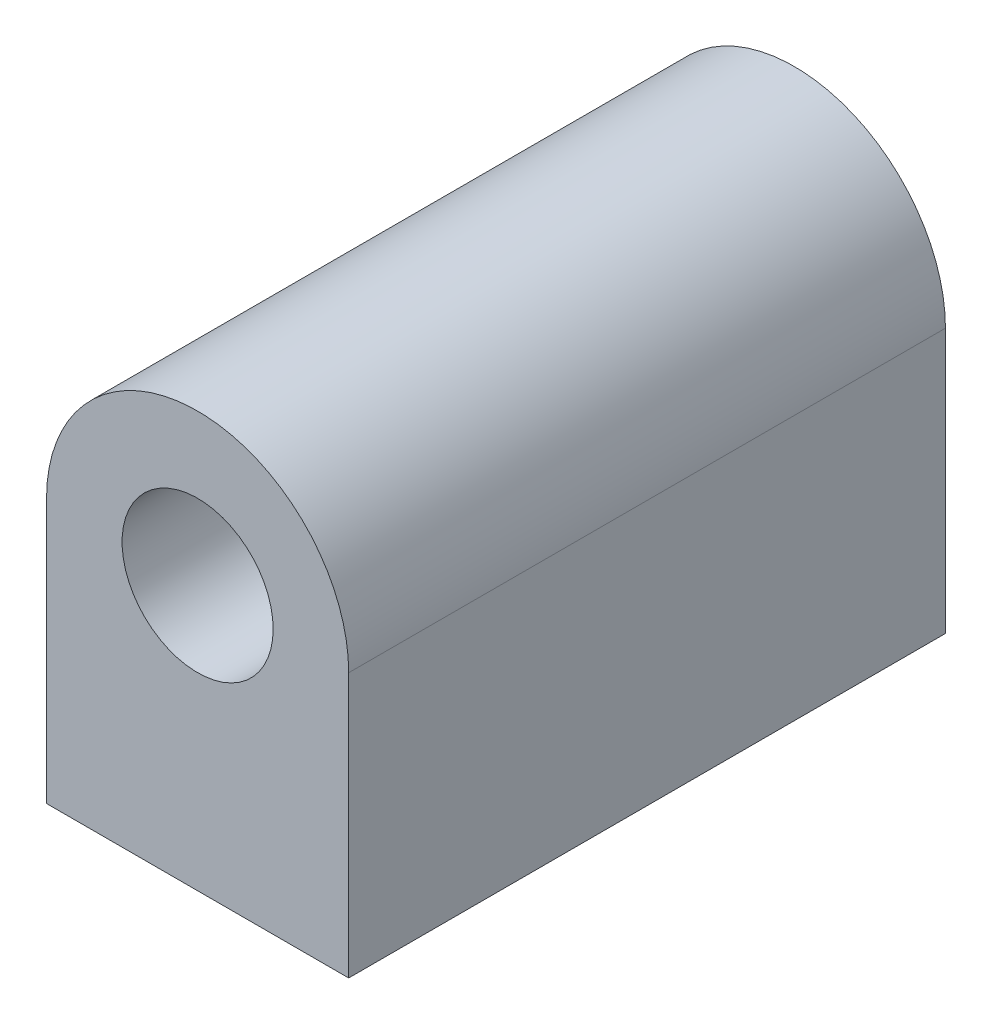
ISO-10303-21;
HEADER;
FILE_DESCRIPTION(('STEP AP214'),'2;1');
FILE_NAME('part.step','',(''),(''),'','','');
FILE_SCHEMA(('AUTOMOTIVE_DESIGN { 1 0 10303 214 1 1 1 1 }'));
ENDSEC;
DATA;
#1=APPLICATION_CONTEXT('core data for automotive mechanical design processes');
#2=APPLICATION_PROTOCOL_DEFINITION('international standard','automotive_design',2000,#1);
#3=PRODUCT_CONTEXT('',#1,'mechanical');
#4=PRODUCT('Part','Part','',(#3));
#5=PRODUCT_RELATED_PRODUCT_CATEGORY('part','',(#4));
#6=PRODUCT_DEFINITION_FORMATION('','',#4);
#7=PRODUCT_DEFINITION_CONTEXT('part definition',#1,'design');
#8=PRODUCT_DEFINITION('design','',#6,#7);
#9=PRODUCT_DEFINITION_SHAPE('','',#8);
#10=(LENGTH_UNIT() NAMED_UNIT(*) SI_UNIT(.MILLI.,.METRE.));
#11=(NAMED_UNIT(*) PLANE_ANGLE_UNIT() SI_UNIT($,.RADIAN.));
#12=(NAMED_UNIT(*) SI_UNIT($,.STERADIAN.) SOLID_ANGLE_UNIT());
#13=UNCERTAINTY_MEASURE_WITH_UNIT(LENGTH_MEASURE(1.E-05),#10,'distance_accuracy_value','');
#14=(GEOMETRIC_REPRESENTATION_CONTEXT(3) GLOBAL_UNCERTAINTY_ASSIGNED_CONTEXT((#13)) GLOBAL_UNIT_ASSIGNED_CONTEXT((#10,
#11,#12)) REPRESENTATION_CONTEXT('',''));
#15=CARTESIAN_POINT('',(0.,0.,0.));
#16=DIRECTION('',(0.,0.,1.));
#17=DIRECTION('',(1.,0.,0.));
#18=AXIS2_PLACEMENT_3D('',#15,#16,#17);
#19=CARTESIAN_POINT('',(-20.,0.,39.5));
#20=DIRECTION('',(1.,0.,0.));
#21=DIRECTION('',(0.,0.,-1.));
#22=AXIS2_PLACEMENT_3D('',#19,#20,#21);
#23=PLANE('',#22);
#24=DIRECTION('',(0.,-1.,0.));
#25=VECTOR('',#24,1.);
#26=CARTESIAN_POINT('',(-20.,0.,-39.5));
#27=LINE('',#26,#25);
#28=CARTESIAN_POINT('',(-20.,35.,-39.5));
#29=VERTEX_POINT('',#28);
#30=CARTESIAN_POINT('',(-20.,0.,-39.5));
#31=VERTEX_POINT('',#30);
#32=EDGE_CURVE('E96',#29,#31,#27,.T.);
#33=ORIENTED_EDGE('',*,*,#32,.T.);
#34=DIRECTION('',(0.,0.,-1.));
#35=VECTOR('',#34,1.);
#36=CARTESIAN_POINT('',(-20.,0.,39.5));
#37=LINE('',#36,#35);
#38=CARTESIAN_POINT('',(-20.,0.,39.5));
#39=VERTEX_POINT('',#38);
#40=EDGE_CURVE('E11',#39,#31,#37,.T.);
#41=ORIENTED_EDGE('',*,*,#40,.F.);
#42=DIRECTION('',(0.,-1.,0.));
#43=VECTOR('',#42,1.);
#44=CARTESIAN_POINT('',(-20.,0.,39.5));
#45=LINE('',#44,#43);
#46=CARTESIAN_POINT('',(-20.,35.,39.5));
#47=VERTEX_POINT('',#46);
#48=EDGE_CURVE('E84',#47,#39,#45,.T.);
#49=ORIENTED_EDGE('',*,*,#48,.F.);
#50=DIRECTION('',(0.,0.,-1.));
#51=VECTOR('',#50,1.);
#52=CARTESIAN_POINT('',(-20.,35.,39.5));
#53=LINE('',#52,#51);
#54=EDGE_CURVE('E92',#47,#29,#53,.T.);
#55=ORIENTED_EDGE('',*,*,#54,.T.);
#56=EDGE_LOOP('',(#33,#41,#49,#55));
#57=FACE_BOUND('',#56,.T.);
#58=ADVANCED_FACE('F33',(#57),#23,.F.);
#59=CARTESIAN_POINT('',(-20.,0.,39.5));
#60=DIRECTION('',(0.,1.,0.));
#61=DIRECTION('',(0.,0.,1.));
#62=AXIS2_PLACEMENT_3D('',#59,#60,#61);
#63=PLANE('',#62);
#64=DIRECTION('',(1.,0.,0.));
#65=VECTOR('',#64,1.);
#66=CARTESIAN_POINT('',(-20.,0.,-39.5));
#67=LINE('',#66,#65);
#68=CARTESIAN_POINT('',(20.,0.,-39.5));
#69=VERTEX_POINT('',#68);
#70=EDGE_CURVE('E88',#31,#69,#67,.T.);
#71=ORIENTED_EDGE('',*,*,#70,.T.);
#72=DIRECTION('',(0.,0.,-1.));
#73=VECTOR('',#72,1.);
#74=CARTESIAN_POINT('',(20.,0.,39.5));
#75=LINE('',#74,#73);
#76=CARTESIAN_POINT('',(20.,0.,39.5));
#77=VERTEX_POINT('',#76);
#78=EDGE_CURVE('E41',#77,#69,#75,.T.);
#79=ORIENTED_EDGE('',*,*,#78,.F.);
#80=DIRECTION('',(1.,0.,0.));
#81=VECTOR('',#80,1.);
#82=CARTESIAN_POINT('',(-20.,0.,39.5));
#83=LINE('',#82,#81);
#84=EDGE_CURVE('E79',#39,#77,#83,.T.);
#85=ORIENTED_EDGE('',*,*,#84,.F.);
#86=ORIENTED_EDGE('',*,*,#40,.T.);
#87=EDGE_LOOP('',(#71,#79,#85,#86));
#88=FACE_BOUND('',#87,.T.);
#89=ADVANCED_FACE('F87',(#88),#63,.F.);
#90=CARTESIAN_POINT('',(20.,0.,39.5));
#91=DIRECTION('',(-1.,0.,0.));
#92=DIRECTION('',(0.,0.,1.));
#93=AXIS2_PLACEMENT_3D('',#90,#91,#92);
#94=PLANE('',#93);
#95=DIRECTION('',(0.,1.,0.));
#96=VECTOR('',#95,1.);
#97=CARTESIAN_POINT('',(20.,0.,-39.5));
#98=LINE('',#97,#96);
#99=CARTESIAN_POINT('',(20.,35.,-39.5));
#100=VERTEX_POINT('',#99);
#101=EDGE_CURVE('E66',#69,#100,#98,.T.);
#102=ORIENTED_EDGE('',*,*,#101,.T.);
#103=DIRECTION('',(0.,0.,-1.));
#104=VECTOR('',#103,1.);
#105=CARTESIAN_POINT('',(20.,35.,39.5));
#106=LINE('',#105,#104);
#107=CARTESIAN_POINT('',(20.,35.,39.5));
#108=VERTEX_POINT('',#107);
#109=EDGE_CURVE('E89',#108,#100,#106,.T.);
#110=ORIENTED_EDGE('',*,*,#109,.F.);
#111=DIRECTION('',(0.,1.,0.));
#112=VECTOR('',#111,1.);
#113=CARTESIAN_POINT('',(20.,0.,39.5));
#114=LINE('',#113,#112);
#115=EDGE_CURVE('E82',#77,#108,#114,.T.);
#116=ORIENTED_EDGE('',*,*,#115,.F.);
#117=ORIENTED_EDGE('',*,*,#78,.T.);
#118=EDGE_LOOP('',(#102,#110,#116,#117));
#119=FACE_BOUND('',#118,.T.);
#120=ADVANCED_FACE('F90',(#119),#94,.F.);
#121=CARTESIAN_POINT('',(0.,35.,39.5));
#122=DIRECTION('',(0.,0.,-1.));
#123=DIRECTION('',(-1.,0.,0.));
#124=AXIS2_PLACEMENT_3D('',#121,#122,#123);
#125=CYLINDRICAL_SURFACE('',#124,20.);
#126=CARTESIAN_POINT('',(0.,35.,-39.5));
#127=DIRECTION('',(0.,0.,1.));
#128=DIRECTION('',(-1.,0.,0.));
#129=AXIS2_PLACEMENT_3D('',#126,#127,#128);
#130=CIRCLE('',#129,20.);
#131=EDGE_CURVE('E72',#100,#29,#130,.T.);
#132=ORIENTED_EDGE('',*,*,#131,.T.);
#133=ORIENTED_EDGE('',*,*,#54,.F.);
#134=CARTESIAN_POINT('',(0.,35.,39.5));
#135=DIRECTION('',(0.,0.,1.));
#136=DIRECTION('',(-1.,0.,0.));
#137=AXIS2_PLACEMENT_3D('',#134,#135,#136);
#138=CIRCLE('',#137,20.);
#139=EDGE_CURVE('E49',#108,#47,#138,.T.);
#140=ORIENTED_EDGE('',*,*,#139,.F.);
#141=ORIENTED_EDGE('',*,*,#109,.T.);
#142=EDGE_LOOP('',(#132,#133,#140,#141));
#143=FACE_BOUND('',#142,.T.);
#144=ADVANCED_FACE('F104',(#143),#125,.T.);
#145=CARTESIAN_POINT('',(0.,35.,39.5));
#146=DIRECTION('',(0.,0.,-1.));
#147=DIRECTION('',(-1.,0.,0.));
#148=AXIS2_PLACEMENT_3D('',#145,#146,#147);
#149=PLANE('',#148);
#150=CARTESIAN_POINT('',(0.,35.,39.5));
#151=DIRECTION('',(0.,0.,1.));
#152=DIRECTION('',(1.,0.,0.));
#153=AXIS2_PLACEMENT_3D('',#150,#151,#152);
#154=CIRCLE('',#153,10.);
#155=CARTESIAN_POINT('',(10.,35.,39.5));
#156=VERTEX_POINT('',#155);
#157=EDGE_CURVE('E110',#156,#156,#154,.T.);
#158=ORIENTED_EDGE('',*,*,#157,.F.);
#159=EDGE_LOOP('',(#158));
#160=FACE_BOUND('',#159,.T.);
#161=ORIENTED_EDGE('',*,*,#48,.T.);
#162=ORIENTED_EDGE('',*,*,#84,.T.);
#163=ORIENTED_EDGE('',*,*,#115,.T.);
#164=ORIENTED_EDGE('',*,*,#139,.T.);
#165=EDGE_LOOP('',(#161,#162,#163,#164));
#166=FACE_BOUND('',#165,.T.);
#167=ADVANCED_FACE('F80',(#160,#166),#149,.F.);
#168=CARTESIAN_POINT('',(0.,35.,-39.5));
#169=DIRECTION('',(0.,0.,-1.));
#170=DIRECTION('',(-1.,0.,0.));
#171=AXIS2_PLACEMENT_3D('',#168,#169,#170);
#172=PLANE('',#171);
#173=CARTESIAN_POINT('',(0.,35.,-39.5));
#174=DIRECTION('',(0.,0.,1.));
#175=DIRECTION('',(1.,0.,0.));
#176=AXIS2_PLACEMENT_3D('',#173,#174,#175);
#177=CIRCLE('',#176,10.);
#178=CARTESIAN_POINT('',(10.,35.,-39.5));
#179=VERTEX_POINT('',#178);
#180=EDGE_CURVE('E99',#179,#179,#177,.T.);
#181=ORIENTED_EDGE('',*,*,#180,.T.);
#182=EDGE_LOOP('',(#181));
#183=FACE_BOUND('',#182,.T.);
#184=ORIENTED_EDGE('',*,*,#32,.F.);
#185=ORIENTED_EDGE('',*,*,#131,.F.);
#186=ORIENTED_EDGE('',*,*,#101,.F.);
#187=ORIENTED_EDGE('',*,*,#70,.F.);
#188=EDGE_LOOP('',(#184,#185,#186,#187));
#189=FACE_BOUND('',#188,.T.);
#190=ADVANCED_FACE('F107',(#183,#189),#172,.T.);
#191=CARTESIAN_POINT('',(0.,35.,-39.5));
#192=DIRECTION('',(0.,0.,1.));
#193=DIRECTION('',(1.,0.,0.));
#194=AXIS2_PLACEMENT_3D('',#191,#192,#193);
#195=CYLINDRICAL_SURFACE('',#194,10.);
#196=ORIENTED_EDGE('',*,*,#180,.F.);
#197=EDGE_LOOP('',(#196));
#198=FACE_BOUND('',#197,.T.);
#199=ORIENTED_EDGE('',*,*,#157,.T.);
#200=EDGE_LOOP('',(#199));
#201=FACE_BOUND('',#200,.T.);
#202=ADVANCED_FACE('F117',(#198,#201),#195,.F.);
#203=CLOSED_SHELL('',(#58,#89,#120,#144,#167,#190,#202));
#204=MANIFOLD_SOLID_BREP('B2',#203);
#205=ADVANCED_BREP_SHAPE_REPRESENTATION('',(#18,#204),#14);
#206=SHAPE_DEFINITION_REPRESENTATION(#9,#205);
ENDSEC;
END-ISO-10303-21;
